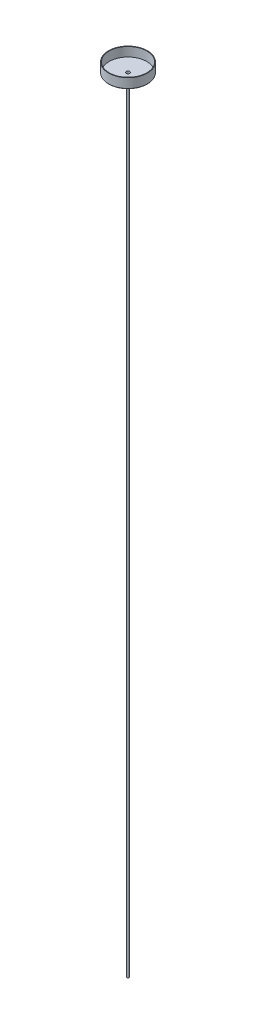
ISO-10303-21;
HEADER;
FILE_DESCRIPTION(('STEP AP214'),'2;1');
FILE_NAME('part.step','',(''),(''),'','','');
FILE_SCHEMA(('AUTOMOTIVE_DESIGN { 1 0 10303 214 1 1 1 1 }'));
ENDSEC;
DATA;
#1=APPLICATION_CONTEXT('core data for automotive mechanical design processes');
#2=APPLICATION_PROTOCOL_DEFINITION('international standard','automotive_design',2000,#1);
#3=PRODUCT_CONTEXT('',#1,'mechanical');
#4=PRODUCT('Part','Part','',(#3));
#5=PRODUCT_RELATED_PRODUCT_CATEGORY('part','',(#4));
#6=PRODUCT_DEFINITION_FORMATION('','',#4);
#7=PRODUCT_DEFINITION_CONTEXT('part definition',#1,'design');
#8=PRODUCT_DEFINITION('design','',#6,#7);
#9=PRODUCT_DEFINITION_SHAPE('','',#8);
#10=(LENGTH_UNIT() NAMED_UNIT(*) SI_UNIT(.MILLI.,.METRE.));
#11=(NAMED_UNIT(*) PLANE_ANGLE_UNIT() SI_UNIT($,.RADIAN.));
#12=(NAMED_UNIT(*) SI_UNIT($,.STERADIAN.) SOLID_ANGLE_UNIT());
#13=UNCERTAINTY_MEASURE_WITH_UNIT(LENGTH_MEASURE(1.E-05),#10,'distance_accuracy_value','');
#14=(GEOMETRIC_REPRESENTATION_CONTEXT(3) GLOBAL_UNCERTAINTY_ASSIGNED_CONTEXT((#13)) GLOBAL_UNIT_ASSIGNED_CONTEXT((#10,
#11,#12)) REPRESENTATION_CONTEXT('',''));
#15=CARTESIAN_POINT('',(0.,0.,0.));
#16=DIRECTION('',(0.,0.,1.));
#17=DIRECTION('',(1.,0.,0.));
#18=AXIS2_PLACEMENT_3D('',#15,#16,#17);
#19=CARTESIAN_POINT('',(0.,2015.,0.));
#20=DIRECTION('',(0.,-1.,0.));
#21=DIRECTION('',(0.,0.,-1.));
#22=AXIS2_PLACEMENT_3D('',#19,#20,#21);
#23=CYLINDRICAL_SURFACE('',#22,6.);
#24=CARTESIAN_POINT('',(0.,2015.,0.));
#25=DIRECTION('',(0.,1.,0.));
#26=DIRECTION('',(0.,0.,1.));
#27=AXIS2_PLACEMENT_3D('',#24,#25,#26);
#28=CIRCLE('',#27,6.);
#29=CARTESIAN_POINT('',(0.,2015.,6.));
#30=VERTEX_POINT('',#29);
#31=EDGE_CURVE('E50',#30,#30,#28,.T.);
#32=ORIENTED_EDGE('',*,*,#31,.F.);
#33=EDGE_LOOP('',(#32));
#34=FACE_BOUND('',#33,.T.);
#35=CARTESIAN_POINT('',(0.,2000.,0.));
#36=DIRECTION('',(0.,1.,0.));
#37=DIRECTION('',(0.,0.,1.));
#38=AXIS2_PLACEMENT_3D('',#35,#36,#37);
#39=CIRCLE('',#38,6.);
#40=CARTESIAN_POINT('',(0.,2000.,6.));
#41=VERTEX_POINT('',#40);
#42=EDGE_CURVE('E54',#41,#41,#39,.T.);
#43=ORIENTED_EDGE('',*,*,#42,.T.);
#44=EDGE_LOOP('',(#43));
#45=FACE_BOUND('',#44,.T.);
#46=ADVANCED_FACE('F39',(#34,#45),#23,.T.);
#47=CARTESIAN_POINT('',(0.,2000.,0.));
#48=DIRECTION('',(0.,1.,0.));
#49=DIRECTION('',(0.,0.,1.));
#50=AXIS2_PLACEMENT_3D('',#47,#48,#49);
#51=PLANE('',#50);
#52=ORIENTED_EDGE('',*,*,#42,.F.);
#53=EDGE_LOOP('',(#52));
#54=FACE_BOUND('',#53,.T.);
#55=ADVANCED_FACE('F91',(#54),#51,.F.);
#56=CARTESIAN_POINT('',(0.,2040.,0.));
#57=DIRECTION('',(0.,-1.,0.));
#58=DIRECTION('',(0.,0.,-1.));
#59=AXIS2_PLACEMENT_3D('',#56,#57,#58);
#60=CYLINDRICAL_SURFACE('',#59,50.);
#61=CARTESIAN_POINT('',(0.,2016.,0.));
#62=DIRECTION('',(0.,1.,0.));
#63=DIRECTION('',(0.,0.,1.));
#64=AXIS2_PLACEMENT_3D('',#61,#62,#63);
#65=CIRCLE('',#64,50.);
#66=CARTESIAN_POINT('',(0.,2016.,50.));
#67=VERTEX_POINT('',#66);
#68=EDGE_CURVE('E46',#67,#67,#65,.T.);
#69=ORIENTED_EDGE('',*,*,#68,.T.);
#70=EDGE_LOOP('',(#69));
#71=FACE_BOUND('',#70,.T.);
#72=CARTESIAN_POINT('',(0.,2040.,0.));
#73=DIRECTION('',(0.,1.,0.));
#74=DIRECTION('',(0.,0.,1.));
#75=AXIS2_PLACEMENT_3D('',#72,#73,#74);
#76=CIRCLE('',#75,50.);
#77=CARTESIAN_POINT('',(0.,2040.,50.));
#78=VERTEX_POINT('',#77);
#79=EDGE_CURVE('E58',#78,#78,#76,.T.);
#80=ORIENTED_EDGE('',*,*,#79,.F.);
#81=EDGE_LOOP('',(#80));
#82=FACE_BOUND('',#81,.T.);
#83=ADVANCED_FACE('F96',(#71,#82),#60,.T.);
#84=CARTESIAN_POINT('',(0.,2040.,0.));
#85=DIRECTION('',(0.,1.,0.));
#86=DIRECTION('',(0.,0.,1.));
#87=AXIS2_PLACEMENT_3D('',#84,#85,#86);
#88=PLANE('',#87);
#89=CARTESIAN_POINT('',(0.,2040.,0.));
#90=DIRECTION('',(0.,1.,0.));
#91=DIRECTION('',(0.,0.,1.));
#92=AXIS2_PLACEMENT_3D('',#89,#90,#91);
#93=CIRCLE('',#92,48.5);
#94=CARTESIAN_POINT('',(0.,2040.,48.5));
#95=VERTEX_POINT('',#94);
#96=EDGE_CURVE('E63',#95,#95,#93,.T.);
#97=ORIENTED_EDGE('',*,*,#96,.F.);
#98=EDGE_LOOP('',(#97));
#99=FACE_BOUND('',#98,.T.);
#100=ORIENTED_EDGE('',*,*,#79,.T.);
#101=EDGE_LOOP('',(#100));
#102=FACE_BOUND('',#101,.T.);
#103=ADVANCED_FACE('F104',(#99,#102),#88,.T.);
#104=CARTESIAN_POINT('',(0.,2015.,0.));
#105=DIRECTION('',(0.,1.,0.));
#106=DIRECTION('',(0.,0.,1.));
#107=AXIS2_PLACEMENT_3D('',#104,#105,#106);
#108=PLANE('',#107);
#109=CARTESIAN_POINT('',(0.,2015.,0.));
#110=DIRECTION('',(0.,1.,0.));
#111=DIRECTION('',(0.,0.,1.));
#112=AXIS2_PLACEMENT_3D('',#109,#110,#111);
#113=CIRCLE('',#112,49.);
#114=CARTESIAN_POINT('',(0.,2015.,49.));
#115=VERTEX_POINT('',#114);
#116=EDGE_CURVE('E11',#115,#115,#113,.F.);
#117=ORIENTED_EDGE('',*,*,#116,.T.);
#118=EDGE_LOOP('',(#117));
#119=FACE_BOUND('',#118,.T.);
#120=ORIENTED_EDGE('',*,*,#31,.T.);
#121=EDGE_LOOP('',(#120));
#122=FACE_BOUND('',#121,.T.);
#123=ADVANCED_FACE('F105',(#119,#122),#108,.F.);
#124=CARTESIAN_POINT('',(0.,2016.,0.));
#125=DIRECTION('',(0.,1.,0.));
#126=DIRECTION('',(0.,0.,1.));
#127=AXIS2_PLACEMENT_3D('',#124,#125,#126);
#128=TOROIDAL_SURFACE('',#127,49.,1.);
#129=ORIENTED_EDGE('',*,*,#116,.F.);
#130=EDGE_LOOP('',(#129));
#131=FACE_BOUND('',#130,.T.);
#132=ORIENTED_EDGE('',*,*,#68,.F.);
#133=EDGE_LOOP('',(#132));
#134=FACE_BOUND('',#133,.T.);
#135=ADVANCED_FACE('F41',(#131,#134),#128,.T.);
#136=CARTESIAN_POINT('',(0.,2015.,0.));
#137=DIRECTION('',(0.,-1.,0.));
#138=DIRECTION('',(0.,0.,-1.));
#139=AXIS2_PLACEMENT_3D('',#136,#137,#138);
#140=CYLINDRICAL_SURFACE('',#139,4.5);
#141=CARTESIAN_POINT('',(0.,2016.5,0.));
#142=DIRECTION('',(0.,1.,0.));
#143=DIRECTION('',(0.,0.,1.));
#144=AXIS2_PLACEMENT_3D('',#141,#142,#143);
#145=CIRCLE('',#144,4.5);
#146=CARTESIAN_POINT('',(0.,2016.5,4.5));
#147=VERTEX_POINT('',#146);
#148=EDGE_CURVE('E69',#147,#147,#145,.T.);
#149=ORIENTED_EDGE('',*,*,#148,.T.);
#150=EDGE_LOOP('',(#149));
#151=FACE_BOUND('',#150,.T.);
#152=CARTESIAN_POINT('',(0.,2001.5,0.));
#153=DIRECTION('',(0.,1.,0.));
#154=DIRECTION('',(0.,0.,1.));
#155=AXIS2_PLACEMENT_3D('',#152,#153,#154);
#156=CIRCLE('',#155,4.5);
#157=CARTESIAN_POINT('',(0.,2001.5,4.5));
#158=VERTEX_POINT('',#157);
#159=EDGE_CURVE('E66',#158,#158,#156,.T.);
#160=ORIENTED_EDGE('',*,*,#159,.F.);
#161=EDGE_LOOP('',(#160));
#162=FACE_BOUND('',#161,.T.);
#163=ADVANCED_FACE('F75',(#151,#162),#140,.F.);
#164=CARTESIAN_POINT('',(0.,2001.5,0.));
#165=DIRECTION('',(0.,1.,0.));
#166=DIRECTION('',(0.,0.,1.));
#167=AXIS2_PLACEMENT_3D('',#164,#165,#166);
#168=PLANE('',#167);
#169=ORIENTED_EDGE('',*,*,#159,.T.);
#170=EDGE_LOOP('',(#169));
#171=FACE_BOUND('',#170,.T.);
#172=ADVANCED_FACE('F86',(#171),#168,.T.);
#173=CARTESIAN_POINT('',(0.,2040.,0.));
#174=DIRECTION('',(0.,-1.,0.));
#175=DIRECTION('',(0.,0.,-1.));
#176=AXIS2_PLACEMENT_3D('',#173,#174,#175);
#177=CYLINDRICAL_SURFACE('',#176,48.5);
#178=CARTESIAN_POINT('',(0.,2016.5,0.));
#179=DIRECTION('',(0.,1.,0.));
#180=DIRECTION('',(0.,0.,1.));
#181=AXIS2_PLACEMENT_3D('',#178,#179,#180);
#182=CIRCLE('',#181,48.5);
#183=CARTESIAN_POINT('',(0.,2016.5,48.5));
#184=VERTEX_POINT('',#183);
#185=EDGE_CURVE('E62',#184,#184,#182,.T.);
#186=ORIENTED_EDGE('',*,*,#185,.F.);
#187=EDGE_LOOP('',(#186));
#188=FACE_BOUND('',#187,.T.);
#189=ORIENTED_EDGE('',*,*,#96,.T.);
#190=EDGE_LOOP('',(#189));
#191=FACE_BOUND('',#190,.T.);
#192=ADVANCED_FACE('F80',(#188,#191),#177,.F.);
#193=CARTESIAN_POINT('',(0.,2016.5,0.));
#194=DIRECTION('',(0.,1.,0.));
#195=DIRECTION('',(0.,0.,1.));
#196=AXIS2_PLACEMENT_3D('',#193,#194,#195);
#197=PLANE('',#196);
#198=ORIENTED_EDGE('',*,*,#185,.T.);
#199=EDGE_LOOP('',(#198));
#200=FACE_BOUND('',#199,.T.);
#201=ORIENTED_EDGE('',*,*,#148,.F.);
#202=EDGE_LOOP('',(#201));
#203=FACE_BOUND('',#202,.T.);
#204=ADVANCED_FACE('F78',(#200,#203),#197,.T.);
#205=CLOSED_SHELL('',(#46,#55,#83,#103,#123,#135,#163,#172,#192,#204));
#206=MANIFOLD_SOLID_BREP('B2',#205);
#207=CARTESIAN_POINT('',(0.,2000.,0.));
#208=DIRECTION('',(0.,-1.,0.));
#209=DIRECTION('',(0.,0.,-1.));
#210=AXIS2_PLACEMENT_3D('',#207,#208,#209);
#211=CYLINDRICAL_SURFACE('',#210,3.);
#212=CARTESIAN_POINT('',(0.,2000.,0.));
#213=DIRECTION('',(0.,1.,0.));
#214=DIRECTION('',(0.,0.,1.));
#215=AXIS2_PLACEMENT_3D('',#212,#213,#214);
#216=CIRCLE('',#215,3.);
#217=CARTESIAN_POINT('',(0.,2000.,3.));
#218=VERTEX_POINT('',#217);
#219=EDGE_CURVE('E38',#218,#218,#216,.T.);
#220=ORIENTED_EDGE('',*,*,#219,.F.);
#221=EDGE_LOOP('',(#220));
#222=FACE_BOUND('',#221,.T.);
#223=CARTESIAN_POINT('',(0.,0.,0.));
#224=DIRECTION('',(0.,1.,0.));
#225=DIRECTION('',(0.,0.,1.));
#226=AXIS2_PLACEMENT_3D('',#223,#224,#225);
#227=CIRCLE('',#226,3.);
#228=CARTESIAN_POINT('',(0.,0.,3.));
#229=VERTEX_POINT('',#228);
#230=EDGE_CURVE('E188',#229,#229,#227,.T.);
#231=ORIENTED_EDGE('',*,*,#230,.T.);
#232=EDGE_LOOP('',(#231));
#233=FACE_BOUND('',#232,.T.);
#234=ADVANCED_FACE('F185',(#222,#233),#211,.T.);
#235=CARTESIAN_POINT('',(0.,2000.,0.));
#236=DIRECTION('',(0.,1.,0.));
#237=DIRECTION('',(0.,0.,1.));
#238=AXIS2_PLACEMENT_3D('',#235,#236,#237);
#239=PLANE('',#238);
#240=ORIENTED_EDGE('',*,*,#219,.T.);
#241=EDGE_LOOP('',(#240));
#242=FACE_BOUND('',#241,.T.);
#243=ADVANCED_FACE('F200',(#242),#239,.T.);
#244=CARTESIAN_POINT('',(0.,0.,0.));
#245=DIRECTION('',(0.,1.,0.));
#246=DIRECTION('',(0.,0.,1.));
#247=AXIS2_PLACEMENT_3D('',#244,#245,#246);
#248=PLANE('',#247);
#249=ORIENTED_EDGE('',*,*,#230,.F.);
#250=EDGE_LOOP('',(#249));
#251=FACE_BOUND('',#250,.T.);
#252=ADVANCED_FACE('F198',(#251),#248,.F.);
#253=CLOSED_SHELL('',(#234,#243,#252));
#254=MANIFOLD_SOLID_BREP('B6',#253);
#255=ADVANCED_BREP_SHAPE_REPRESENTATION('',(#18,#206,#254),#14);
#256=SHAPE_DEFINITION_REPRESENTATION(#9,#255);
ENDSEC;
END-ISO-10303-21;
